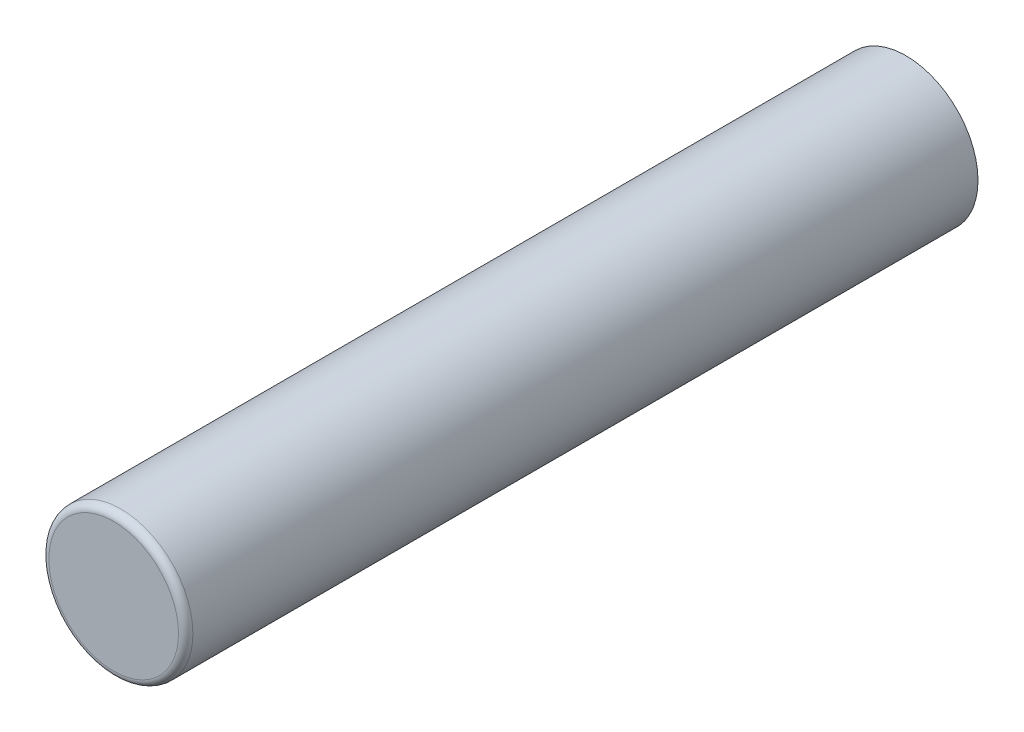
from build123d import *

# Parameters (mm, degrees)
ESQUISSE1_R            = 1
CYLINDRE_DE_BASE_DEPTH = 5.5
CONG_1_R               = 0.1


with BuildPart() as part:
    # Esquisse1 → Cylindre de base (new, symmetric)
    with BuildSketch(Plane.XY):
        Circle(ESQUISSE1_R)
    extrude(amount=CYLINDRE_DE_BASE_DEPTH, both=True)

    # Cong_1
    cong_1_edges = [part.edges().sort_by_distance(p)[0] for p in [
        (-1, 0, 5.5),
    ]]
    fillet(cong_1_edges, radius=CONG_1_R)


solid = part.part
